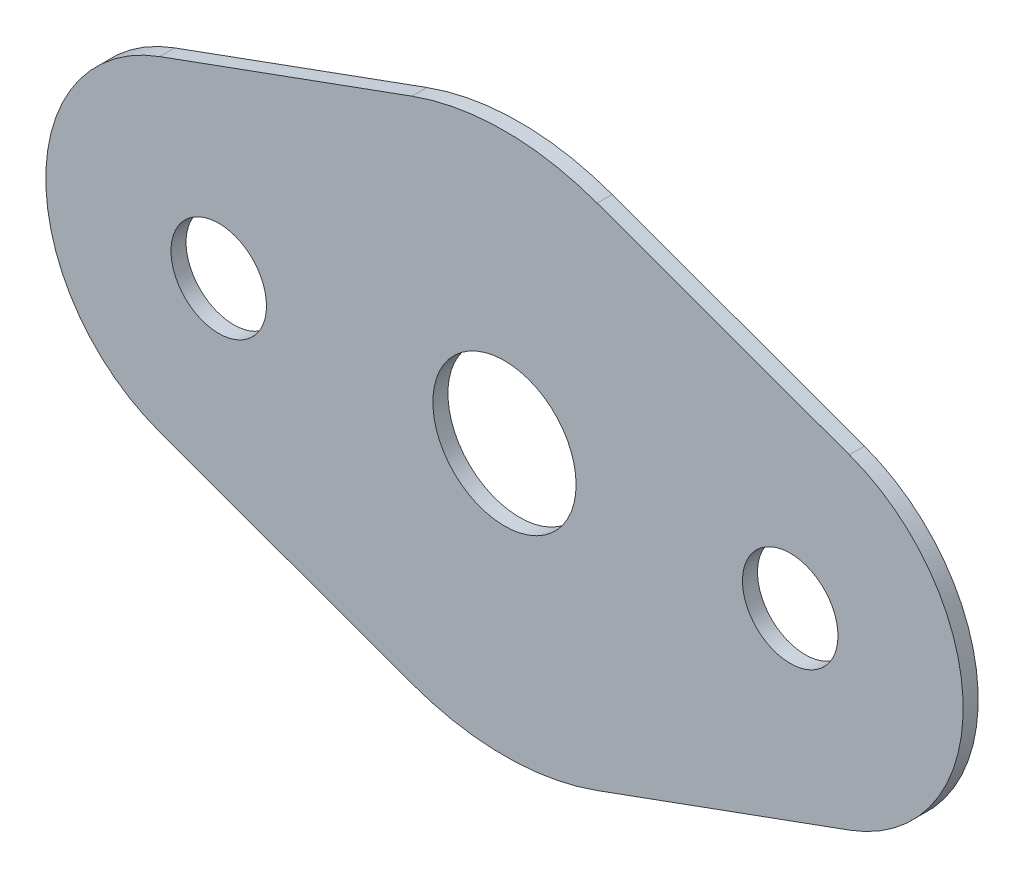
ISO-10303-21;
HEADER;
FILE_DESCRIPTION(('STEP AP214'),'2;1');
FILE_NAME('part.step','',(''),(''),'','','');
FILE_SCHEMA(('AUTOMOTIVE_DESIGN { 1 0 10303 214 1 1 1 1 }'));
ENDSEC;
DATA;
#1=APPLICATION_CONTEXT('core data for automotive mechanical design processes');
#2=APPLICATION_PROTOCOL_DEFINITION('international standard','automotive_design',2000,#1);
#3=PRODUCT_CONTEXT('',#1,'mechanical');
#4=PRODUCT('Part','Part','',(#3));
#5=PRODUCT_RELATED_PRODUCT_CATEGORY('part','',(#4));
#6=PRODUCT_DEFINITION_FORMATION('','',#4);
#7=PRODUCT_DEFINITION_CONTEXT('part definition',#1,'design');
#8=PRODUCT_DEFINITION('design','',#6,#7);
#9=PRODUCT_DEFINITION_SHAPE('','',#8);
#10=(LENGTH_UNIT() NAMED_UNIT(*) SI_UNIT(.MILLI.,.METRE.));
#11=(NAMED_UNIT(*) PLANE_ANGLE_UNIT() SI_UNIT($,.RADIAN.));
#12=(NAMED_UNIT(*) SI_UNIT($,.STERADIAN.) SOLID_ANGLE_UNIT());
#13=UNCERTAINTY_MEASURE_WITH_UNIT(LENGTH_MEASURE(1.E-05),#10,'distance_accuracy_value','');
#14=(GEOMETRIC_REPRESENTATION_CONTEXT(3) GLOBAL_UNCERTAINTY_ASSIGNED_CONTEXT((#13)) GLOBAL_UNIT_ASSIGNED_CONTEXT((#10,
#11,#12)) REPRESENTATION_CONTEXT('',''));
#15=CARTESIAN_POINT('',(0.,0.,0.));
#16=DIRECTION('',(0.,0.,1.));
#17=DIRECTION('',(1.,0.,0.));
#18=AXIS2_PLACEMENT_3D('',#15,#16,#17);
#19=CARTESIAN_POINT('',(0.,0.,1.));
#20=DIRECTION('',(0.,0.,1.));
#21=DIRECTION('',(1.,0.,0.));
#22=AXIS2_PLACEMENT_3D('',#19,#20,#21);
#23=PLANE('',#22);
#24=CARTESIAN_POINT('',(0.,0.,1.));
#25=DIRECTION('',(0.,0.,1.));
#26=DIRECTION('',(1.,0.,0.));
#27=AXIS2_PLACEMENT_3D('',#24,#25,#26);
#28=CIRCLE('',#27,4.76250000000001);
#29=CARTESIAN_POINT('',(4.76250000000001,0.,1.));
#30=VERTEX_POINT('',#29);
#31=EDGE_CURVE('E191',#30,#30,#28,.T.);
#32=ORIENTED_EDGE('',*,*,#31,.F.);
#33=EDGE_LOOP('',(#32));
#34=FACE_BOUND('',#33,.T.);
#35=CARTESIAN_POINT('',(0.,0.,1.));
#36=DIRECTION('',(0.,0.,1.));
#37=DIRECTION('',(1.,0.,0.));
#38=AXIS2_PLACEMENT_3D('',#35,#36,#37);
#39=CIRCLE('',#38,18.);
#40=CARTESIAN_POINT('',(-6.1578947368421,-16.9139094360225,1.));
#41=VERTEX_POINT('',#40);
#42=CARTESIAN_POINT('',(6.1578947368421,-16.9139094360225,1.));
#43=VERTEX_POINT('',#42);
#44=EDGE_CURVE('E153',#41,#43,#39,.T.);
#45=ORIENTED_EDGE('',*,*,#44,.T.);
#46=DIRECTION('',(0.939661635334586,0.342105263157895,0.));
#47=VECTOR('',#46,1.);
#48=CARTESIAN_POINT('',(6.1578947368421,-16.9139094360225,1.));
#49=LINE('',#48,#47);
#50=CARTESIAN_POINT('',(22.9342105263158,-10.8061088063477,1.));
#51=VERTEX_POINT('',#50);
#52=EDGE_CURVE('E96',#43,#51,#49,.T.);
#53=ORIENTED_EDGE('',*,*,#52,.T.);
#54=CARTESIAN_POINT('',(19.,0.,1.));
#55=DIRECTION('',(0.,0.,1.));
#56=DIRECTION('',(1.,0.,0.));
#57=AXIS2_PLACEMENT_3D('',#54,#55,#56);
#58=CIRCLE('',#57,11.5);
#59=CARTESIAN_POINT('',(22.9342105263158,10.8061088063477,1.));
#60=VERTEX_POINT('',#59);
#61=EDGE_CURVE('E168',#51,#60,#58,.T.);
#62=ORIENTED_EDGE('',*,*,#61,.T.);
#63=DIRECTION('',(-0.939661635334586,0.342105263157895,0.));
#64=VECTOR('',#63,1.);
#65=CARTESIAN_POINT('',(22.9342105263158,10.8061088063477,1.));
#66=LINE('',#65,#64);
#67=CARTESIAN_POINT('',(6.15789473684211,16.9139094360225,1.));
#68=VERTEX_POINT('',#67);
#69=EDGE_CURVE('E181',#60,#68,#66,.T.);
#70=ORIENTED_EDGE('',*,*,#69,.T.);
#71=CARTESIAN_POINT('',(0.,0.,1.));
#72=DIRECTION('',(0.,0.,1.));
#73=DIRECTION('',(1.,0.,0.));
#74=AXIS2_PLACEMENT_3D('',#71,#72,#73);
#75=CIRCLE('',#74,18.);
#76=CARTESIAN_POINT('',(-6.1578947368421,16.9139094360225,1.));
#77=VERTEX_POINT('',#76);
#78=EDGE_CURVE('E115',#68,#77,#75,.T.);
#79=ORIENTED_EDGE('',*,*,#78,.T.);
#80=DIRECTION('',(-0.939661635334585,-0.342105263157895,0.));
#81=VECTOR('',#80,1.);
#82=CARTESIAN_POINT('',(-6.1578947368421,16.9139094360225,1.));
#83=LINE('',#82,#81);
#84=CARTESIAN_POINT('',(-22.9342105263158,10.8061088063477,1.));
#85=VERTEX_POINT('',#84);
#86=EDGE_CURVE('E109',#77,#85,#83,.T.);
#87=ORIENTED_EDGE('',*,*,#86,.T.);
#88=CARTESIAN_POINT('',(-19.,0.,1.));
#89=DIRECTION('',(0.,0.,1.));
#90=DIRECTION('',(1.,0.,0.));
#91=AXIS2_PLACEMENT_3D('',#88,#89,#90);
#92=CIRCLE('',#91,11.5);
#93=CARTESIAN_POINT('',(-22.9342105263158,-10.8061088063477,1.));
#94=VERTEX_POINT('',#93);
#95=EDGE_CURVE('E113',#85,#94,#92,.T.);
#96=ORIENTED_EDGE('',*,*,#95,.T.);
#97=DIRECTION('',(0.939661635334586,-0.342105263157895,0.));
#98=VECTOR('',#97,1.);
#99=CARTESIAN_POINT('',(-22.9342105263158,-10.8061088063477,1.));
#100=LINE('',#99,#98);
#101=EDGE_CURVE('E53',#94,#41,#100,.T.);
#102=ORIENTED_EDGE('',*,*,#101,.T.);
#103=EDGE_LOOP('',(#45,#53,#62,#70,#79,#87,#96,#102));
#104=FACE_BOUND('',#103,.T.);
#105=CARTESIAN_POINT('',(19.,0.,1.));
#106=DIRECTION('',(0.,0.,1.));
#107=DIRECTION('',(1.,0.,0.));
#108=AXIS2_PLACEMENT_3D('',#105,#106,#107);
#109=CIRCLE('',#108,3.175);
#110=CARTESIAN_POINT('',(22.175,0.,1.));
#111=VERTEX_POINT('',#110);
#112=EDGE_CURVE('E142',#111,#111,#109,.T.);
#113=ORIENTED_EDGE('',*,*,#112,.F.);
#114=EDGE_LOOP('',(#113));
#115=FACE_BOUND('',#114,.T.);
#116=CARTESIAN_POINT('',(-19.,0.,1.));
#117=DIRECTION('',(0.,0.,1.));
#118=DIRECTION('',(1.,0.,0.));
#119=AXIS2_PLACEMENT_3D('',#116,#117,#118);
#120=CIRCLE('',#119,3.17500000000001);
#121=CARTESIAN_POINT('',(-15.825,0.,1.));
#122=VERTEX_POINT('',#121);
#123=EDGE_CURVE('E197',#122,#122,#120,.T.);
#124=ORIENTED_EDGE('',*,*,#123,.F.);
#125=EDGE_LOOP('',(#124));
#126=FACE_BOUND('',#125,.T.);
#127=ADVANCED_FACE('F36',(#34,#104,#115,#126),#23,.T.);
#128=CARTESIAN_POINT('',(0.,0.,0.));
#129=DIRECTION('',(0.,0.,1.));
#130=DIRECTION('',(1.,0.,0.));
#131=AXIS2_PLACEMENT_3D('',#128,#129,#130);
#132=PLANE('',#131);
#133=CARTESIAN_POINT('',(0.,0.,0.));
#134=DIRECTION('',(0.,0.,1.));
#135=DIRECTION('',(1.,0.,0.));
#136=AXIS2_PLACEMENT_3D('',#133,#134,#135);
#137=CIRCLE('',#136,4.76250000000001);
#138=CARTESIAN_POINT('',(4.76250000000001,0.,0.));
#139=VERTEX_POINT('',#138);
#140=EDGE_CURVE('E194',#139,#139,#137,.T.);
#141=ORIENTED_EDGE('',*,*,#140,.T.);
#142=EDGE_LOOP('',(#141));
#143=FACE_BOUND('',#142,.T.);
#144=CARTESIAN_POINT('',(0.,0.,0.));
#145=DIRECTION('',(0.,0.,1.));
#146=DIRECTION('',(1.,0.,0.));
#147=AXIS2_PLACEMENT_3D('',#144,#145,#146);
#148=CIRCLE('',#147,18.);
#149=CARTESIAN_POINT('',(-6.1578947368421,-16.9139094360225,0.));
#150=VERTEX_POINT('',#149);
#151=CARTESIAN_POINT('',(6.1578947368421,-16.9139094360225,0.));
#152=VERTEX_POINT('',#151);
#153=EDGE_CURVE('E138',#150,#152,#148,.T.);
#154=ORIENTED_EDGE('',*,*,#153,.F.);
#155=DIRECTION('',(0.939661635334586,-0.342105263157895,0.));
#156=VECTOR('',#155,1.);
#157=CARTESIAN_POINT('',(-22.9342105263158,-10.8061088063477,0.));
#158=LINE('',#157,#156);
#159=CARTESIAN_POINT('',(-22.9342105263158,-10.8061088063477,0.));
#160=VERTEX_POINT('',#159);
#161=EDGE_CURVE('E88',#160,#150,#158,.T.);
#162=ORIENTED_EDGE('',*,*,#161,.F.);
#163=CARTESIAN_POINT('',(-19.,0.,0.));
#164=DIRECTION('',(0.,0.,1.));
#165=DIRECTION('',(1.,0.,0.));
#166=AXIS2_PLACEMENT_3D('',#163,#164,#165);
#167=CIRCLE('',#166,11.5);
#168=CARTESIAN_POINT('',(-22.9342105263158,10.8061088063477,0.));
#169=VERTEX_POINT('',#168);
#170=EDGE_CURVE('E82',#169,#160,#167,.T.);
#171=ORIENTED_EDGE('',*,*,#170,.F.);
#172=DIRECTION('',(-0.939661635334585,-0.342105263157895,0.));
#173=VECTOR('',#172,1.);
#174=CARTESIAN_POINT('',(-6.1578947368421,16.9139094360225,0.));
#175=LINE('',#174,#173);
#176=CARTESIAN_POINT('',(-6.1578947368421,16.9139094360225,0.));
#177=VERTEX_POINT('',#176);
#178=EDGE_CURVE('E123',#177,#169,#175,.T.);
#179=ORIENTED_EDGE('',*,*,#178,.F.);
#180=CARTESIAN_POINT('',(0.,0.,0.));
#181=DIRECTION('',(0.,0.,1.));
#182=DIRECTION('',(1.,0.,0.));
#183=AXIS2_PLACEMENT_3D('',#180,#181,#182);
#184=CIRCLE('',#183,18.);
#185=CARTESIAN_POINT('',(6.15789473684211,16.9139094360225,0.));
#186=VERTEX_POINT('',#185);
#187=EDGE_CURVE('E148',#186,#177,#184,.T.);
#188=ORIENTED_EDGE('',*,*,#187,.F.);
#189=DIRECTION('',(-0.939661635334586,0.342105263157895,0.));
#190=VECTOR('',#189,1.);
#191=CARTESIAN_POINT('',(22.9342105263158,10.8061088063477,0.));
#192=LINE('',#191,#190);
#193=CARTESIAN_POINT('',(22.9342105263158,10.8061088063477,0.));
#194=VERTEX_POINT('',#193);
#195=EDGE_CURVE('E146',#194,#186,#192,.T.);
#196=ORIENTED_EDGE('',*,*,#195,.F.);
#197=CARTESIAN_POINT('',(19.,0.,0.));
#198=DIRECTION('',(0.,0.,1.));
#199=DIRECTION('',(1.,0.,0.));
#200=AXIS2_PLACEMENT_3D('',#197,#198,#199);
#201=CIRCLE('',#200,11.5);
#202=CARTESIAN_POINT('',(22.9342105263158,-10.8061088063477,0.));
#203=VERTEX_POINT('',#202);
#204=EDGE_CURVE('E144',#203,#194,#201,.T.);
#205=ORIENTED_EDGE('',*,*,#204,.F.);
#206=DIRECTION('',(0.939661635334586,0.342105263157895,0.));
#207=VECTOR('',#206,1.);
#208=CARTESIAN_POINT('',(6.1578947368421,-16.9139094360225,0.));
#209=LINE('',#208,#207);
#210=EDGE_CURVE('E141',#152,#203,#209,.T.);
#211=ORIENTED_EDGE('',*,*,#210,.F.);
#212=EDGE_LOOP('',(#154,#162,#171,#179,#188,#196,#205,#211));
#213=FACE_BOUND('',#212,.T.);
#214=CARTESIAN_POINT('',(19.,0.,0.));
#215=DIRECTION('',(0.,0.,1.));
#216=DIRECTION('',(1.,0.,0.));
#217=AXIS2_PLACEMENT_3D('',#214,#215,#216);
#218=CIRCLE('',#217,3.175);
#219=CARTESIAN_POINT('',(22.175,0.,0.));
#220=VERTEX_POINT('',#219);
#221=EDGE_CURVE('E188',#220,#220,#218,.T.);
#222=ORIENTED_EDGE('',*,*,#221,.T.);
#223=EDGE_LOOP('',(#222));
#224=FACE_BOUND('',#223,.T.);
#225=CARTESIAN_POINT('',(-19.,0.,0.));
#226=DIRECTION('',(0.,0.,1.));
#227=DIRECTION('',(1.,0.,0.));
#228=AXIS2_PLACEMENT_3D('',#225,#226,#227);
#229=CIRCLE('',#228,3.17500000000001);
#230=CARTESIAN_POINT('',(-15.825,0.,0.));
#231=VERTEX_POINT('',#230);
#232=EDGE_CURVE('E201',#231,#231,#229,.T.);
#233=ORIENTED_EDGE('',*,*,#232,.T.);
#234=EDGE_LOOP('',(#233));
#235=FACE_BOUND('',#234,.T.);
#236=ADVANCED_FACE('F172',(#143,#213,#224,#235),#132,.F.);
#237=CARTESIAN_POINT('',(0.,0.,1.));
#238=DIRECTION('',(0.,0.,-1.));
#239=DIRECTION('',(-1.,0.,0.));
#240=AXIS2_PLACEMENT_3D('',#237,#238,#239);
#241=CYLINDRICAL_SURFACE('',#240,18.);
#242=ORIENTED_EDGE('',*,*,#153,.T.);
#243=DIRECTION('',(0.,0.,-1.));
#244=VECTOR('',#243,1.);
#245=CARTESIAN_POINT('',(6.1578947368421,-16.9139094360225,1.));
#246=LINE('',#245,#244);
#247=EDGE_CURVE('E11',#43,#152,#246,.T.);
#248=ORIENTED_EDGE('',*,*,#247,.F.);
#249=ORIENTED_EDGE('',*,*,#44,.F.);
#250=DIRECTION('',(0.,0.,-1.));
#251=VECTOR('',#250,1.);
#252=CARTESIAN_POINT('',(-6.1578947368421,-16.9139094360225,1.));
#253=LINE('',#252,#251);
#254=EDGE_CURVE('E134',#41,#150,#253,.T.);
#255=ORIENTED_EDGE('',*,*,#254,.T.);
#256=EDGE_LOOP('',(#242,#248,#249,#255));
#257=FACE_BOUND('',#256,.T.);
#258=ADVANCED_FACE('F38',(#257),#241,.T.);
#259=CARTESIAN_POINT('',(6.1578947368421,-16.9139094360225,1.));
#260=DIRECTION('',(-0.342105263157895,0.939661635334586,0.));
#261=DIRECTION('',(-0.939661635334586,-0.342105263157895,0.));
#262=AXIS2_PLACEMENT_3D('',#259,#260,#261);
#263=PLANE('',#262);
#264=ORIENTED_EDGE('',*,*,#210,.T.);
#265=DIRECTION('',(0.,0.,-1.));
#266=VECTOR('',#265,1.);
#267=CARTESIAN_POINT('',(22.9342105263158,-10.8061088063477,1.));
#268=LINE('',#267,#266);
#269=EDGE_CURVE('E45',#51,#203,#268,.T.);
#270=ORIENTED_EDGE('',*,*,#269,.F.);
#271=ORIENTED_EDGE('',*,*,#52,.F.);
#272=ORIENTED_EDGE('',*,*,#247,.T.);
#273=EDGE_LOOP('',(#264,#270,#271,#272));
#274=FACE_BOUND('',#273,.T.);
#275=ADVANCED_FACE('F238',(#274),#263,.F.);
#276=CARTESIAN_POINT('',(19.,0.,1.));
#277=DIRECTION('',(0.,0.,-1.));
#278=DIRECTION('',(-1.,0.,0.));
#279=AXIS2_PLACEMENT_3D('',#276,#277,#278);
#280=CYLINDRICAL_SURFACE('',#279,11.5);
#281=ORIENTED_EDGE('',*,*,#204,.T.);
#282=DIRECTION('',(0.,0.,-1.));
#283=VECTOR('',#282,1.);
#284=CARTESIAN_POINT('',(22.9342105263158,10.8061088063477,1.));
#285=LINE('',#284,#283);
#286=EDGE_CURVE('E160',#60,#194,#285,.T.);
#287=ORIENTED_EDGE('',*,*,#286,.F.);
#288=ORIENTED_EDGE('',*,*,#61,.F.);
#289=ORIENTED_EDGE('',*,*,#269,.T.);
#290=EDGE_LOOP('',(#281,#287,#288,#289));
#291=FACE_BOUND('',#290,.T.);
#292=ADVANCED_FACE('F166',(#291),#280,.T.);
#293=CARTESIAN_POINT('',(22.9342105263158,10.8061088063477,1.));
#294=DIRECTION('',(-0.342105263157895,-0.939661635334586,0.));
#295=DIRECTION('',(0.939661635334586,-0.342105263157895,0.));
#296=AXIS2_PLACEMENT_3D('',#293,#294,#295);
#297=PLANE('',#296);
#298=ORIENTED_EDGE('',*,*,#195,.T.);
#299=DIRECTION('',(0.,0.,-1.));
#300=VECTOR('',#299,1.);
#301=CARTESIAN_POINT('',(6.15789473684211,16.9139094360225,1.));
#302=LINE('',#301,#300);
#303=EDGE_CURVE('E157',#68,#186,#302,.T.);
#304=ORIENTED_EDGE('',*,*,#303,.F.);
#305=ORIENTED_EDGE('',*,*,#69,.F.);
#306=ORIENTED_EDGE('',*,*,#286,.T.);
#307=EDGE_LOOP('',(#298,#304,#305,#306));
#308=FACE_BOUND('',#307,.T.);
#309=ADVANCED_FACE('F177',(#308),#297,.F.);
#310=CARTESIAN_POINT('',(0.,0.,1.));
#311=DIRECTION('',(0.,0.,-1.));
#312=DIRECTION('',(-1.,0.,0.));
#313=AXIS2_PLACEMENT_3D('',#310,#311,#312);
#314=CYLINDRICAL_SURFACE('',#313,18.);
#315=ORIENTED_EDGE('',*,*,#187,.T.);
#316=DIRECTION('',(0.,0.,-1.));
#317=VECTOR('',#316,1.);
#318=CARTESIAN_POINT('',(-6.1578947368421,16.9139094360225,1.));
#319=LINE('',#318,#317);
#320=EDGE_CURVE('E124',#77,#177,#319,.T.);
#321=ORIENTED_EDGE('',*,*,#320,.F.);
#322=ORIENTED_EDGE('',*,*,#78,.F.);
#323=ORIENTED_EDGE('',*,*,#303,.T.);
#324=EDGE_LOOP('',(#315,#321,#322,#323));
#325=FACE_BOUND('',#324,.T.);
#326=ADVANCED_FACE('F180',(#325),#314,.T.);
#327=CARTESIAN_POINT('',(-6.1578947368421,16.9139094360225,1.));
#328=DIRECTION('',(0.342105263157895,-0.939661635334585,0.));
#329=DIRECTION('',(0.939661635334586,0.342105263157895,0.));
#330=AXIS2_PLACEMENT_3D('',#327,#328,#329);
#331=PLANE('',#330);
#332=ORIENTED_EDGE('',*,*,#178,.T.);
#333=DIRECTION('',(0.,0.,-1.));
#334=VECTOR('',#333,1.);
#335=CARTESIAN_POINT('',(-22.9342105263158,10.8061088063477,1.));
#336=LINE('',#335,#334);
#337=EDGE_CURVE('E120',#85,#169,#336,.T.);
#338=ORIENTED_EDGE('',*,*,#337,.F.);
#339=ORIENTED_EDGE('',*,*,#86,.F.);
#340=ORIENTED_EDGE('',*,*,#320,.T.);
#341=EDGE_LOOP('',(#332,#338,#339,#340));
#342=FACE_BOUND('',#341,.T.);
#343=ADVANCED_FACE('F121',(#342),#331,.F.);
#344=CARTESIAN_POINT('',(-19.,0.,1.));
#345=DIRECTION('',(0.,0.,-1.));
#346=DIRECTION('',(-1.,0.,0.));
#347=AXIS2_PLACEMENT_3D('',#344,#345,#346);
#348=CYLINDRICAL_SURFACE('',#347,11.5);
#349=ORIENTED_EDGE('',*,*,#170,.T.);
#350=DIRECTION('',(0.,0.,-1.));
#351=VECTOR('',#350,1.);
#352=CARTESIAN_POINT('',(-22.9342105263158,-10.8061088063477,1.));
#353=LINE('',#352,#351);
#354=EDGE_CURVE('E125',#94,#160,#353,.T.);
#355=ORIENTED_EDGE('',*,*,#354,.F.);
#356=ORIENTED_EDGE('',*,*,#95,.F.);
#357=ORIENTED_EDGE('',*,*,#337,.T.);
#358=EDGE_LOOP('',(#349,#355,#356,#357));
#359=FACE_BOUND('',#358,.T.);
#360=ADVANCED_FACE('F127',(#359),#348,.T.);
#361=CARTESIAN_POINT('',(-22.9342105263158,-10.8061088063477,1.));
#362=DIRECTION('',(0.342105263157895,0.939661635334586,0.));
#363=DIRECTION('',(-0.939661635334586,0.342105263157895,0.));
#364=AXIS2_PLACEMENT_3D('',#361,#362,#363);
#365=PLANE('',#364);
#366=ORIENTED_EDGE('',*,*,#161,.T.);
#367=ORIENTED_EDGE('',*,*,#254,.F.);
#368=ORIENTED_EDGE('',*,*,#101,.F.);
#369=ORIENTED_EDGE('',*,*,#354,.T.);
#370=EDGE_LOOP('',(#366,#367,#368,#369));
#371=FACE_BOUND('',#370,.T.);
#372=ADVANCED_FACE('F226',(#371),#365,.F.);
#373=CARTESIAN_POINT('',(19.,0.,1.));
#374=DIRECTION('',(0.,0.,-1.));
#375=DIRECTION('',(-1.,0.,0.));
#376=AXIS2_PLACEMENT_3D('',#373,#374,#375);
#377=CYLINDRICAL_SURFACE('',#376,3.175);
#378=ORIENTED_EDGE('',*,*,#112,.T.);
#379=EDGE_LOOP('',(#378));
#380=FACE_BOUND('',#379,.T.);
#381=ORIENTED_EDGE('',*,*,#221,.F.);
#382=EDGE_LOOP('',(#381));
#383=FACE_BOUND('',#382,.T.);
#384=ADVANCED_FACE('F223',(#380,#383),#377,.F.);
#385=CARTESIAN_POINT('',(0.,0.,1.));
#386=DIRECTION('',(0.,0.,-1.));
#387=DIRECTION('',(-1.,0.,0.));
#388=AXIS2_PLACEMENT_3D('',#385,#386,#387);
#389=CYLINDRICAL_SURFACE('',#388,4.76250000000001);
#390=ORIENTED_EDGE('',*,*,#31,.T.);
#391=EDGE_LOOP('',(#390));
#392=FACE_BOUND('',#391,.T.);
#393=ORIENTED_EDGE('',*,*,#140,.F.);
#394=EDGE_LOOP('',(#393));
#395=FACE_BOUND('',#394,.T.);
#396=ADVANCED_FACE('F267',(#392,#395),#389,.F.);
#397=CARTESIAN_POINT('',(-19.,0.,1.));
#398=DIRECTION('',(0.,0.,-1.));
#399=DIRECTION('',(-1.,0.,0.));
#400=AXIS2_PLACEMENT_3D('',#397,#398,#399);
#401=CYLINDRICAL_SURFACE('',#400,3.17500000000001);
#402=ORIENTED_EDGE('',*,*,#123,.T.);
#403=EDGE_LOOP('',(#402));
#404=FACE_BOUND('',#403,.T.);
#405=ORIENTED_EDGE('',*,*,#232,.F.);
#406=EDGE_LOOP('',(#405));
#407=FACE_BOUND('',#406,.T.);
#408=ADVANCED_FACE('F210',(#404,#407),#401,.F.);
#409=CLOSED_SHELL('',(#127,#236,#258,#275,#292,#309,#326,#343,#360,#372,#384,#396,#408));
#410=MANIFOLD_SOLID_BREP('B2',#409);
#411=ADVANCED_BREP_SHAPE_REPRESENTATION('',(#18,#410),#14);
#412=SHAPE_DEFINITION_REPRESENTATION(#9,#411);
ENDSEC;
END-ISO-10303-21;
